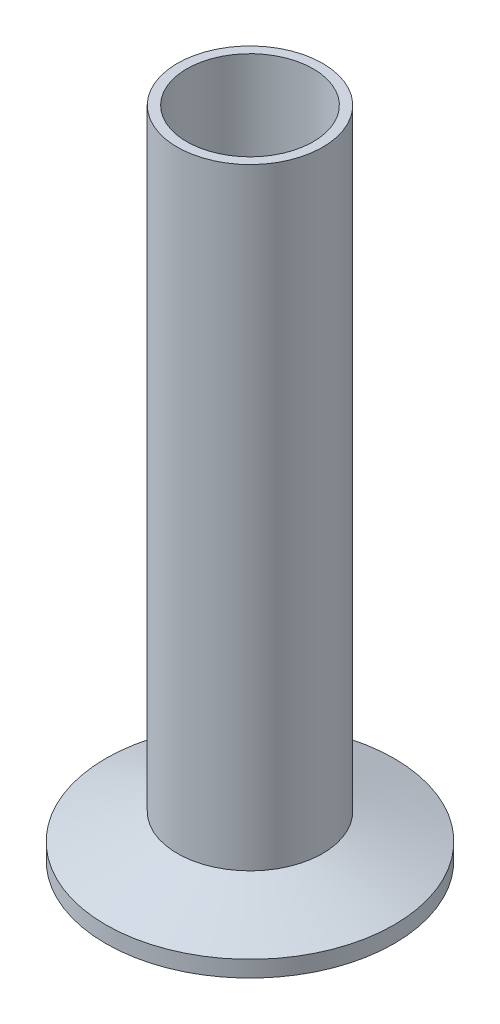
ISO-10303-21;
HEADER;
FILE_DESCRIPTION(('STEP AP214'),'2;1');
FILE_NAME('part.step','',(''),(''),'','','');
FILE_SCHEMA(('AUTOMOTIVE_DESIGN { 1 0 10303 214 1 1 1 1 }'));
ENDSEC;
DATA;
#1=APPLICATION_CONTEXT('core data for automotive mechanical design processes');
#2=APPLICATION_PROTOCOL_DEFINITION('international standard','automotive_design',2000,#1);
#3=PRODUCT_CONTEXT('',#1,'mechanical');
#4=PRODUCT('Part','Part','',(#3));
#5=PRODUCT_RELATED_PRODUCT_CATEGORY('part','',(#4));
#6=PRODUCT_DEFINITION_FORMATION('','',#4);
#7=PRODUCT_DEFINITION_CONTEXT('part definition',#1,'design');
#8=PRODUCT_DEFINITION('design','',#6,#7);
#9=PRODUCT_DEFINITION_SHAPE('','',#8);
#10=(LENGTH_UNIT() NAMED_UNIT(*) SI_UNIT(.MILLI.,.METRE.));
#11=(NAMED_UNIT(*) PLANE_ANGLE_UNIT() SI_UNIT($,.RADIAN.));
#12=(NAMED_UNIT(*) SI_UNIT($,.STERADIAN.) SOLID_ANGLE_UNIT());
#13=UNCERTAINTY_MEASURE_WITH_UNIT(LENGTH_MEASURE(1.E-05),#10,'distance_accuracy_value','');
#14=(GEOMETRIC_REPRESENTATION_CONTEXT(3) GLOBAL_UNCERTAINTY_ASSIGNED_CONTEXT((#13)) GLOBAL_UNIT_ASSIGNED_CONTEXT((#10,
#11,#12)) REPRESENTATION_CONTEXT('',''));
#15=CARTESIAN_POINT('',(0.,0.,0.));
#16=DIRECTION('',(0.,0.,1.));
#17=DIRECTION('',(1.,0.,0.));
#18=AXIS2_PLACEMENT_3D('',#15,#16,#17);
#19=CARTESIAN_POINT('',(0.,0.7874,0.));
#20=DIRECTION('',(0.,-1.,0.));
#21=DIRECTION('',(0.,0.,-1.));
#22=AXIS2_PLACEMENT_3D('',#19,#20,#21);
#23=TOROIDAL_SURFACE('',#22,23.6366084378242,0.787399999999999);
#24=CARTESIAN_POINT('',(0.,0.,0.));
#25=DIRECTION('',(0.,-1.,0.));
#26=DIRECTION('',(0.,0.,-1.));
#27=AXIS2_PLACEMENT_3D('',#24,#25,#26);
#28=CIRCLE('',#27,23.6366084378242);
#29=CARTESIAN_POINT('',(0.,0.,-23.6366084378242));
#30=VERTEX_POINT('',#29);
#31=EDGE_CURVE('E67',#30,#30,#28,.T.);
#32=ORIENTED_EDGE('',*,*,#31,.T.);
#33=EDGE_LOOP('',(#32));
#34=FACE_BOUND('',#33,.T.);
#35=CARTESIAN_POINT('',(0.,0.474458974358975,0.));
#36=DIRECTION('',(0.,-1.,0.));
#37=DIRECTION('',(0.,0.,-1.));
#38=AXIS2_PLACEMENT_3D('',#35,#36,#37);
#39=CIRCLE('',#38,22.9140666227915);
#40=CARTESIAN_POINT('',(0.,0.474458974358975,-22.9140666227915));
#41=VERTEX_POINT('',#40);
#42=EDGE_CURVE('E10',#41,#41,#39,.T.);
#43=ORIENTED_EDGE('',*,*,#42,.F.);
#44=EDGE_LOOP('',(#43));
#45=FACE_BOUND('',#44,.T.);
#46=ADVANCED_FACE('F33',(#34,#45),#23,.T.);
#47=CARTESIAN_POINT('',(0.,0.,0.));
#48=DIRECTION('',(0.,-1.,0.));
#49=DIRECTION('',(0.,0.,-1.));
#50=AXIS2_PLACEMENT_3D('',#47,#48,#49);
#51=TOROIDAL_SURFACE('',#50,21.8186,1.1938);
#52=CARTESIAN_POINT('',(0.,0.474458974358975,0.));
#53=DIRECTION('',(0.,-1.,0.));
#54=DIRECTION('',(0.,0.,-1.));
#55=AXIS2_PLACEMENT_3D('',#52,#53,#54);
#56=CIRCLE('',#55,20.7231333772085);
#57=CARTESIAN_POINT('',(0.,0.474458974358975,-20.7231333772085));
#58=VERTEX_POINT('',#57);
#59=EDGE_CURVE('E39',#58,#58,#56,.T.);
#60=ORIENTED_EDGE('',*,*,#59,.F.);
#61=EDGE_LOOP('',(#60));
#62=FACE_BOUND('',#61,.T.);
#63=ORIENTED_EDGE('',*,*,#42,.T.);
#64=EDGE_LOOP('',(#63));
#65=FACE_BOUND('',#64,.T.);
#66=ADVANCED_FACE('F115',(#62,#65),#51,.F.);
#67=CARTESIAN_POINT('',(0.,0.787400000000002,0.));
#68=DIRECTION('',(0.,-1.,0.));
#69=DIRECTION('',(0.,0.,-1.));
#70=AXIS2_PLACEMENT_3D('',#67,#68,#69);
#71=TOROIDAL_SURFACE('',#70,20.0005915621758,0.787399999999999);
#72=ORIENTED_EDGE('',*,*,#59,.T.);
#73=EDGE_LOOP('',(#72));
#74=FACE_BOUND('',#73,.T.);
#75=CARTESIAN_POINT('',(0.,0.,0.));
#76=DIRECTION('',(0.,-1.,0.));
#77=DIRECTION('',(0.,0.,-1.));
#78=AXIS2_PLACEMENT_3D('',#75,#76,#77);
#79=CIRCLE('',#78,20.0005915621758);
#80=CARTESIAN_POINT('',(0.,0.,-20.0005915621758));
#81=VERTEX_POINT('',#80);
#82=EDGE_CURVE('E43',#81,#81,#79,.T.);
#83=ORIENTED_EDGE('',*,*,#82,.F.);
#84=EDGE_LOOP('',(#83));
#85=FACE_BOUND('',#84,.T.);
#86=ADVANCED_FACE('F111',(#74,#85),#71,.T.);
#87=CARTESIAN_POINT('',(0.,0.,0.));
#88=DIRECTION('',(0.,1.,0.));
#89=DIRECTION('',(0.,0.,1.));
#90=AXIS2_PLACEMENT_3D('',#87,#88,#89);
#91=PLANE('',#90);
#92=CARTESIAN_POINT('',(0.,0.,0.));
#93=DIRECTION('',(0.,-1.,0.));
#94=DIRECTION('',(0.,0.,-1.));
#95=AXIS2_PLACEMENT_3D('',#92,#93,#94);
#96=CIRCLE('',#95,11.049);
#97=CARTESIAN_POINT('',(0.,0.,-11.049));
#98=VERTEX_POINT('',#97);
#99=EDGE_CURVE('E47',#98,#98,#96,.T.);
#100=ORIENTED_EDGE('',*,*,#99,.F.);
#101=EDGE_LOOP('',(#100));
#102=FACE_BOUND('',#101,.T.);
#103=ORIENTED_EDGE('',*,*,#82,.T.);
#104=EDGE_LOOP('',(#103));
#105=FACE_BOUND('',#104,.T.);
#106=ADVANCED_FACE('F105',(#102,#105),#91,.F.);
#107=CARTESIAN_POINT('',(0.,0.,0.));
#108=DIRECTION('',(0.,-1.,0.));
#109=DIRECTION('',(0.,0.,-1.));
#110=AXIS2_PLACEMENT_3D('',#107,#108,#109);
#111=CYLINDRICAL_SURFACE('',#110,11.049);
#112=ORIENTED_EDGE('',*,*,#99,.T.);
#113=EDGE_LOOP('',(#112));
#114=FACE_BOUND('',#113,.T.);
#115=CARTESIAN_POINT('',(0.,114.3,0.));
#116=DIRECTION('',(0.,-1.,0.));
#117=DIRECTION('',(0.,0.,-1.));
#118=AXIS2_PLACEMENT_3D('',#115,#116,#117);
#119=CIRCLE('',#118,11.049);
#120=CARTESIAN_POINT('',(0.,114.3,-11.049));
#121=VERTEX_POINT('',#120);
#122=EDGE_CURVE('E52',#121,#121,#119,.T.);
#123=ORIENTED_EDGE('',*,*,#122,.F.);
#124=EDGE_LOOP('',(#123));
#125=FACE_BOUND('',#124,.T.);
#126=ADVANCED_FACE('F100',(#114,#125),#111,.F.);
#127=CARTESIAN_POINT('',(-1.2490009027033E-13,114.3,0.));
#128=DIRECTION('',(0.,-1.,0.));
#129=DIRECTION('',(0.,0.,-1.));
#130=AXIS2_PLACEMENT_3D('',#127,#128,#129);
#131=PLANE('',#130);
#132=CARTESIAN_POINT('',(0.,114.3,0.));
#133=DIRECTION('',(0.,-1.,0.));
#134=DIRECTION('',(0.,0.,-1.));
#135=AXIS2_PLACEMENT_3D('',#132,#133,#134);
#136=CIRCLE('',#135,12.7);
#137=CARTESIAN_POINT('',(0.,114.3,-12.7));
#138=VERTEX_POINT('',#137);
#139=EDGE_CURVE('E55',#138,#138,#136,.T.);
#140=ORIENTED_EDGE('',*,*,#139,.F.);
#141=EDGE_LOOP('',(#140));
#142=FACE_BOUND('',#141,.T.);
#143=ORIENTED_EDGE('',*,*,#122,.T.);
#144=EDGE_LOOP('',(#143));
#145=FACE_BOUND('',#144,.T.);
#146=ADVANCED_FACE('F94',(#142,#145),#131,.F.);
#147=CARTESIAN_POINT('',(0.,0.,0.));
#148=DIRECTION('',(0.,-1.,0.));
#149=DIRECTION('',(0.,0.,-1.));
#150=AXIS2_PLACEMENT_3D('',#147,#148,#149);
#151=CYLINDRICAL_SURFACE('',#150,12.7);
#152=CARTESIAN_POINT('',(0.,7.39326322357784,0.));
#153=DIRECTION('',(0.,-1.,0.));
#154=DIRECTION('',(0.,0.,-1.));
#155=AXIS2_PLACEMENT_3D('',#152,#153,#154);
#156=CIRCLE('',#155,12.7);
#157=CARTESIAN_POINT('',(0.,7.39326322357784,-12.7));
#158=VERTEX_POINT('',#157);
#159=EDGE_CURVE('E58',#158,#158,#156,.T.);
#160=ORIENTED_EDGE('',*,*,#159,.F.);
#161=EDGE_LOOP('',(#160));
#162=FACE_BOUND('',#161,.T.);
#163=ORIENTED_EDGE('',*,*,#139,.T.);
#164=EDGE_LOOP('',(#163));
#165=FACE_BOUND('',#164,.T.);
#166=ADVANCED_FACE('F88',(#162,#165),#151,.T.);
#167=CARTESIAN_POINT('',(0.,7.39326322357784,0.));
#168=DIRECTION('',(0.,-1.,0.));
#169=DIRECTION('',(0.,0.,-1.));
#170=AXIS2_PLACEMENT_3D('',#167,#168,#169);
#171=CONICAL_SURFACE('',#170,12.7,1.22173047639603);
#172=CARTESIAN_POINT('',(0.,2.8448,0.));
#173=DIRECTION('',(0.,-1.,0.));
#174=DIRECTION('',(0.,0.,-1.));
#175=AXIS2_PLACEMENT_3D('',#172,#173,#174);
#176=CIRCLE('',#175,25.1968);
#177=CARTESIAN_POINT('',(0.,2.8448,-25.1968));
#178=VERTEX_POINT('',#177);
#179=EDGE_CURVE('E61',#178,#178,#176,.T.);
#180=ORIENTED_EDGE('',*,*,#179,.F.);
#181=EDGE_LOOP('',(#180));
#182=FACE_BOUND('',#181,.T.);
#183=ORIENTED_EDGE('',*,*,#159,.T.);
#184=EDGE_LOOP('',(#183));
#185=FACE_BOUND('',#184,.T.);
#186=ADVANCED_FACE('F82',(#182,#185),#171,.T.);
#187=CARTESIAN_POINT('',(0.,0.,0.));
#188=DIRECTION('',(0.,-1.,0.));
#189=DIRECTION('',(0.,0.,-1.));
#190=AXIS2_PLACEMENT_3D('',#187,#188,#189);
#191=CYLINDRICAL_SURFACE('',#190,25.1968);
#192=CARTESIAN_POINT('',(0.,0.,0.));
#193=DIRECTION('',(0.,-1.,0.));
#194=DIRECTION('',(0.,0.,-1.));
#195=AXIS2_PLACEMENT_3D('',#192,#193,#194);
#196=CIRCLE('',#195,25.1968);
#197=CARTESIAN_POINT('',(0.,0.,-25.1968));
#198=VERTEX_POINT('',#197);
#199=EDGE_CURVE('E64',#198,#198,#196,.T.);
#200=ORIENTED_EDGE('',*,*,#199,.F.);
#201=EDGE_LOOP('',(#200));
#202=FACE_BOUND('',#201,.T.);
#203=ORIENTED_EDGE('',*,*,#179,.T.);
#204=EDGE_LOOP('',(#203));
#205=FACE_BOUND('',#204,.T.);
#206=ADVANCED_FACE('F76',(#202,#205),#191,.T.);
#207=CARTESIAN_POINT('',(0.,0.,0.));
#208=DIRECTION('',(0.,1.,0.));
#209=DIRECTION('',(0.,0.,1.));
#210=AXIS2_PLACEMENT_3D('',#207,#208,#209);
#211=PLANE('',#210);
#212=ORIENTED_EDGE('',*,*,#31,.F.);
#213=EDGE_LOOP('',(#212));
#214=FACE_BOUND('',#213,.T.);
#215=ORIENTED_EDGE('',*,*,#199,.T.);
#216=EDGE_LOOP('',(#215));
#217=FACE_BOUND('',#216,.T.);
#218=ADVANCED_FACE('F73',(#214,#217),#211,.F.);
#219=CLOSED_SHELL('',(#46,#66,#86,#106,#126,#146,#166,#186,#206,#218));
#220=MANIFOLD_SOLID_BREP('B2',#219);
#221=ADVANCED_BREP_SHAPE_REPRESENTATION('',(#18,#220),#14);
#222=SHAPE_DEFINITION_REPRESENTATION(#9,#221);
ENDSEC;
END-ISO-10303-21;
